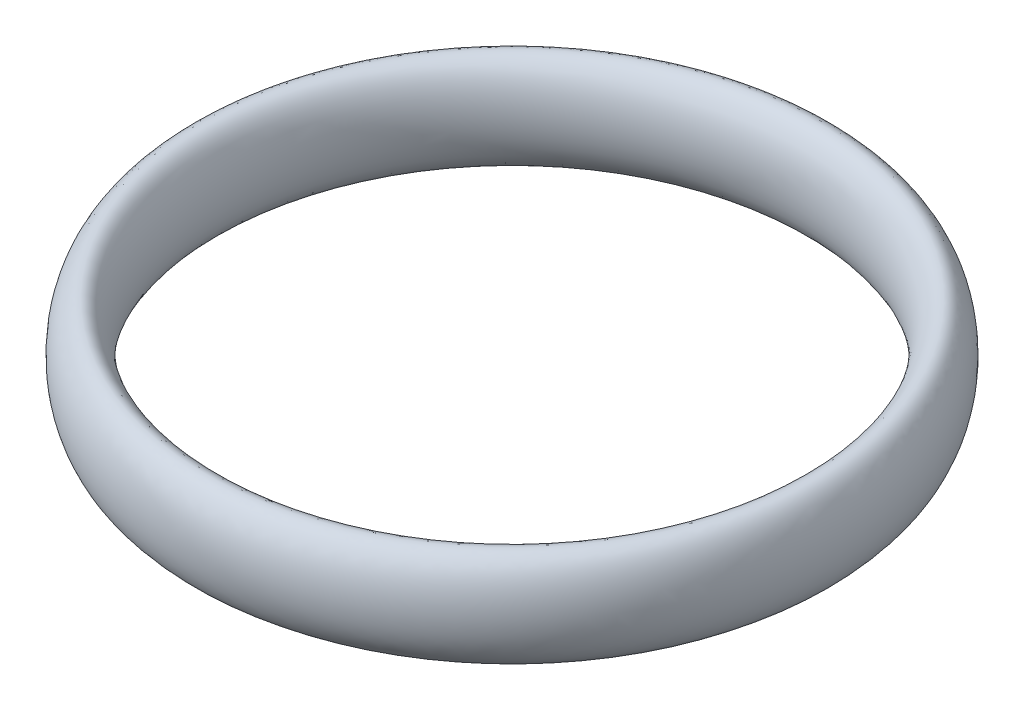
ISO-10303-21;
HEADER;
FILE_DESCRIPTION(('STEP AP214'),'2;1');
FILE_NAME('part.step','',(''),(''),'','','');
FILE_SCHEMA(('AUTOMOTIVE_DESIGN { 1 0 10303 214 1 1 1 1 }'));
ENDSEC;
DATA;
#1=APPLICATION_CONTEXT('core data for automotive mechanical design processes');
#2=APPLICATION_PROTOCOL_DEFINITION('international standard','automotive_design',2000,#1);
#3=PRODUCT_CONTEXT('',#1,'mechanical');
#4=PRODUCT('Part','Part','',(#3));
#5=PRODUCT_RELATED_PRODUCT_CATEGORY('part','',(#4));
#6=PRODUCT_DEFINITION_FORMATION('','',#4);
#7=PRODUCT_DEFINITION_CONTEXT('part definition',#1,'design');
#8=PRODUCT_DEFINITION('design','',#6,#7);
#9=PRODUCT_DEFINITION_SHAPE('','',#8);
#10=(LENGTH_UNIT() NAMED_UNIT(*) SI_UNIT(.MILLI.,.METRE.));
#11=(NAMED_UNIT(*) PLANE_ANGLE_UNIT() SI_UNIT($,.RADIAN.));
#12=(NAMED_UNIT(*) SI_UNIT($,.STERADIAN.) SOLID_ANGLE_UNIT());
#13=UNCERTAINTY_MEASURE_WITH_UNIT(LENGTH_MEASURE(1.E-05),#10,'distance_accuracy_value','');
#14=(GEOMETRIC_REPRESENTATION_CONTEXT(3) GLOBAL_UNCERTAINTY_ASSIGNED_CONTEXT((#13)) GLOBAL_UNIT_ASSIGNED_CONTEXT((#10,
#11,#12)) REPRESENTATION_CONTEXT('',''));
#15=CARTESIAN_POINT('',(0.,0.,0.));
#16=DIRECTION('',(0.,0.,1.));
#17=DIRECTION('',(1.,0.,0.));
#18=AXIS2_PLACEMENT_3D('',#15,#16,#17);
#19=CARTESIAN_POINT('',(6.35,1.01599999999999,0.));
#20=DIRECTION('',(0.,0.,1.));
#21=DIRECTION('',(0.,1.,0.));
#22=AXIS2_PLACEMENT_3D('',#19,#20,#21);
#23=ELLIPSE('',#22,1.016,0.508);
#24=CARTESIAN_POINT('',(0.,0.,0.));
#25=DIRECTION('',(0.,-1.,0.));
#26=AXIS1_PLACEMENT('',#24,#25);
#27=SURFACE_OF_REVOLUTION('',#23,#26);
#28=ADVANCED_FACE('F25',(),#27,.F.);
#29=CLOSED_SHELL('',(#28));
#30=MANIFOLD_SOLID_BREP('B2',#29);
#31=ADVANCED_BREP_SHAPE_REPRESENTATION('',(#18,#30),#14);
#32=SHAPE_DEFINITION_REPRESENTATION(#9,#31);
ENDSEC;
END-ISO-10303-21;
